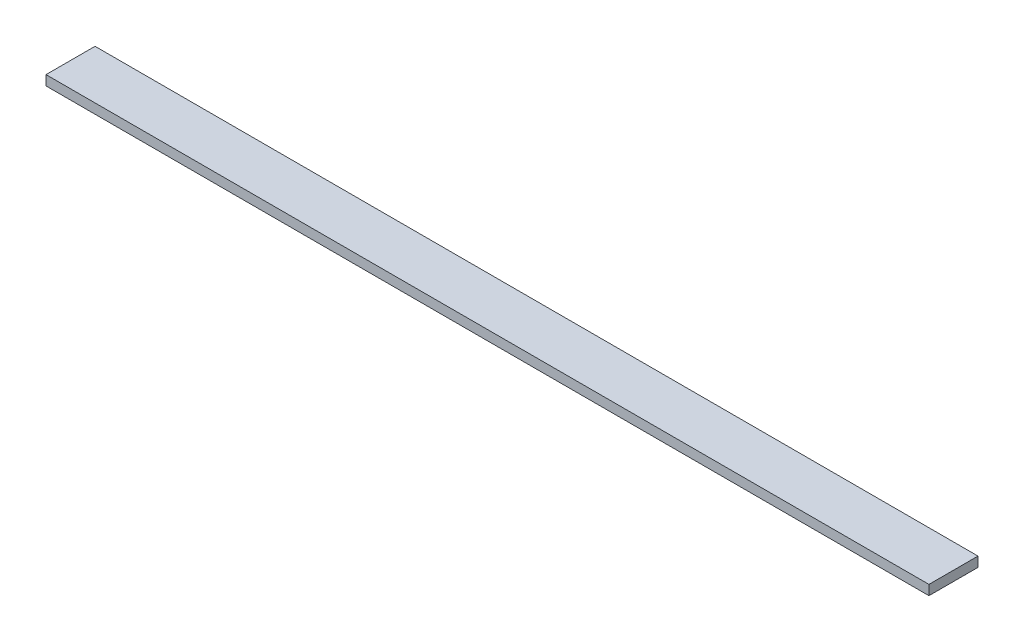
ISO-10303-21;
HEADER;
FILE_DESCRIPTION(('STEP AP214'),'2;1');
FILE_NAME('part.step','',(''),(''),'','','');
FILE_SCHEMA(('AUTOMOTIVE_DESIGN { 1 0 10303 214 1 1 1 1 }'));
ENDSEC;
DATA;
#1=APPLICATION_CONTEXT('core data for automotive mechanical design processes');
#2=APPLICATION_PROTOCOL_DEFINITION('international standard','automotive_design',2000,#1);
#3=PRODUCT_CONTEXT('',#1,'mechanical');
#4=PRODUCT('Part','Part','',(#3));
#5=PRODUCT_RELATED_PRODUCT_CATEGORY('part','',(#4));
#6=PRODUCT_DEFINITION_FORMATION('','',#4);
#7=PRODUCT_DEFINITION_CONTEXT('part definition',#1,'design');
#8=PRODUCT_DEFINITION('design','',#6,#7);
#9=PRODUCT_DEFINITION_SHAPE('','',#8);
#10=(LENGTH_UNIT() NAMED_UNIT(*) SI_UNIT(.MILLI.,.METRE.));
#11=(NAMED_UNIT(*) PLANE_ANGLE_UNIT() SI_UNIT($,.RADIAN.));
#12=(NAMED_UNIT(*) SI_UNIT($,.STERADIAN.) SOLID_ANGLE_UNIT());
#13=UNCERTAINTY_MEASURE_WITH_UNIT(LENGTH_MEASURE(1.E-05),#10,'distance_accuracy_value','');
#14=(GEOMETRIC_REPRESENTATION_CONTEXT(3) GLOBAL_UNCERTAINTY_ASSIGNED_CONTEXT((#13)) GLOBAL_UNIT_ASSIGNED_CONTEXT((#10,
#11,#12)) REPRESENTATION_CONTEXT('',''));
#15=CARTESIAN_POINT('',(0.,0.,0.));
#16=DIRECTION('',(0.,0.,1.));
#17=DIRECTION('',(1.,0.,0.));
#18=AXIS2_PLACEMENT_3D('',#15,#16,#17);
#19=CARTESIAN_POINT('',(180.,1.,-5.));
#20=DIRECTION('',(0.,0.,1.));
#21=DIRECTION('',(1.,0.,0.));
#22=AXIS2_PLACEMENT_3D('',#19,#20,#21);
#23=PLANE('',#22);
#24=DIRECTION('',(0.,1.,0.));
#25=VECTOR('',#24,1.);
#26=CARTESIAN_POINT('',(0.,1.,-5.));
#27=LINE('',#26,#25);
#28=CARTESIAN_POINT('',(0.,-1.,-5.));
#29=VERTEX_POINT('',#28);
#30=CARTESIAN_POINT('',(0.,1.,-5.));
#31=VERTEX_POINT('',#30);
#32=EDGE_CURVE('E96',#29,#31,#27,.T.);
#33=ORIENTED_EDGE('',*,*,#32,.T.);
#34=DIRECTION('',(-1.,0.,0.));
#35=VECTOR('',#34,1.);
#36=CARTESIAN_POINT('',(180.,1.,-5.));
#37=LINE('',#36,#35);
#38=CARTESIAN_POINT('',(180.,1.,-5.));
#39=VERTEX_POINT('',#38);
#40=EDGE_CURVE('E11',#39,#31,#37,.T.);
#41=ORIENTED_EDGE('',*,*,#40,.F.);
#42=DIRECTION('',(0.,1.,0.));
#43=VECTOR('',#42,1.);
#44=CARTESIAN_POINT('',(180.,1.,-5.));
#45=LINE('',#44,#43);
#46=CARTESIAN_POINT('',(180.,-1.,-5.));
#47=VERTEX_POINT('',#46);
#48=EDGE_CURVE('E84',#47,#39,#45,.T.);
#49=ORIENTED_EDGE('',*,*,#48,.F.);
#50=DIRECTION('',(-1.,0.,0.));
#51=VECTOR('',#50,1.);
#52=CARTESIAN_POINT('',(180.,-1.,-5.));
#53=LINE('',#52,#51);
#54=EDGE_CURVE('E92',#47,#29,#53,.T.);
#55=ORIENTED_EDGE('',*,*,#54,.T.);
#56=EDGE_LOOP('',(#33,#41,#49,#55));
#57=FACE_BOUND('',#56,.T.);
#58=ADVANCED_FACE('F33',(#57),#23,.F.);
#59=CARTESIAN_POINT('',(180.,1.,5.));
#60=DIRECTION('',(0.,-1.,0.));
#61=DIRECTION('',(0.,0.,-1.));
#62=AXIS2_PLACEMENT_3D('',#59,#60,#61);
#63=PLANE('',#62);
#64=DIRECTION('',(0.,0.,1.));
#65=VECTOR('',#64,1.);
#66=CARTESIAN_POINT('',(0.,1.,5.));
#67=LINE('',#66,#65);
#68=CARTESIAN_POINT('',(0.,1.,5.));
#69=VERTEX_POINT('',#68);
#70=EDGE_CURVE('E88',#31,#69,#67,.T.);
#71=ORIENTED_EDGE('',*,*,#70,.T.);
#72=DIRECTION('',(-1.,0.,0.));
#73=VECTOR('',#72,1.);
#74=CARTESIAN_POINT('',(180.,1.,5.));
#75=LINE('',#74,#73);
#76=CARTESIAN_POINT('',(180.,1.,5.));
#77=VERTEX_POINT('',#76);
#78=EDGE_CURVE('E41',#77,#69,#75,.T.);
#79=ORIENTED_EDGE('',*,*,#78,.F.);
#80=DIRECTION('',(0.,0.,1.));
#81=VECTOR('',#80,1.);
#82=CARTESIAN_POINT('',(180.,1.,5.));
#83=LINE('',#82,#81);
#84=EDGE_CURVE('E79',#39,#77,#83,.T.);
#85=ORIENTED_EDGE('',*,*,#84,.F.);
#86=ORIENTED_EDGE('',*,*,#40,.T.);
#87=EDGE_LOOP('',(#71,#79,#85,#86));
#88=FACE_BOUND('',#87,.T.);
#89=ADVANCED_FACE('F87',(#88),#63,.F.);
#90=CARTESIAN_POINT('',(180.,1.,5.));
#91=DIRECTION('',(0.,0.,-1.));
#92=DIRECTION('',(-1.,0.,0.));
#93=AXIS2_PLACEMENT_3D('',#90,#91,#92);
#94=PLANE('',#93);
#95=DIRECTION('',(0.,-1.,0.));
#96=VECTOR('',#95,1.);
#97=CARTESIAN_POINT('',(0.,1.,5.));
#98=LINE('',#97,#96);
#99=CARTESIAN_POINT('',(0.,-1.,5.));
#100=VERTEX_POINT('',#99);
#101=EDGE_CURVE('E66',#69,#100,#98,.T.);
#102=ORIENTED_EDGE('',*,*,#101,.T.);
#103=DIRECTION('',(-1.,0.,0.));
#104=VECTOR('',#103,1.);
#105=CARTESIAN_POINT('',(180.,-1.,5.));
#106=LINE('',#105,#104);
#107=CARTESIAN_POINT('',(180.,-1.,5.));
#108=VERTEX_POINT('',#107);
#109=EDGE_CURVE('E89',#108,#100,#106,.T.);
#110=ORIENTED_EDGE('',*,*,#109,.F.);
#111=DIRECTION('',(0.,-1.,0.));
#112=VECTOR('',#111,1.);
#113=CARTESIAN_POINT('',(180.,1.,5.));
#114=LINE('',#113,#112);
#115=EDGE_CURVE('E82',#77,#108,#114,.T.);
#116=ORIENTED_EDGE('',*,*,#115,.F.);
#117=ORIENTED_EDGE('',*,*,#78,.T.);
#118=EDGE_LOOP('',(#102,#110,#116,#117));
#119=FACE_BOUND('',#118,.T.);
#120=ADVANCED_FACE('F90',(#119),#94,.F.);
#121=CARTESIAN_POINT('',(180.,-1.,5.));
#122=DIRECTION('',(0.,1.,0.));
#123=DIRECTION('',(0.,0.,1.));
#124=AXIS2_PLACEMENT_3D('',#121,#122,#123);
#125=PLANE('',#124);
#126=DIRECTION('',(0.,0.,-1.));
#127=VECTOR('',#126,1.);
#128=CARTESIAN_POINT('',(0.,-1.,5.));
#129=LINE('',#128,#127);
#130=EDGE_CURVE('E72',#100,#29,#129,.T.);
#131=ORIENTED_EDGE('',*,*,#130,.T.);
#132=ORIENTED_EDGE('',*,*,#54,.F.);
#133=DIRECTION('',(0.,0.,-1.));
#134=VECTOR('',#133,1.);
#135=CARTESIAN_POINT('',(180.,-1.,5.));
#136=LINE('',#135,#134);
#137=EDGE_CURVE('E49',#108,#47,#136,.T.);
#138=ORIENTED_EDGE('',*,*,#137,.F.);
#139=ORIENTED_EDGE('',*,*,#109,.T.);
#140=EDGE_LOOP('',(#131,#132,#138,#139));
#141=FACE_BOUND('',#140,.T.);
#142=ADVANCED_FACE('F103',(#141),#125,.F.);
#143=CARTESIAN_POINT('',(180.,0.,0.));
#144=DIRECTION('',(1.,0.,0.));
#145=DIRECTION('',(0.,0.,-1.));
#146=AXIS2_PLACEMENT_3D('',#143,#144,#145);
#147=PLANE('',#146);
#148=ORIENTED_EDGE('',*,*,#48,.T.);
#149=ORIENTED_EDGE('',*,*,#84,.T.);
#150=ORIENTED_EDGE('',*,*,#115,.T.);
#151=ORIENTED_EDGE('',*,*,#137,.T.);
#152=EDGE_LOOP('',(#148,#149,#150,#151));
#153=FACE_BOUND('',#152,.T.);
#154=ADVANCED_FACE('F80',(#153),#147,.T.);
#155=CARTESIAN_POINT('',(0.,0.,0.));
#156=DIRECTION('',(1.,0.,0.));
#157=DIRECTION('',(0.,0.,-1.));
#158=AXIS2_PLACEMENT_3D('',#155,#156,#157);
#159=PLANE('',#158);
#160=ORIENTED_EDGE('',*,*,#32,.F.);
#161=ORIENTED_EDGE('',*,*,#130,.F.);
#162=ORIENTED_EDGE('',*,*,#101,.F.);
#163=ORIENTED_EDGE('',*,*,#70,.F.);
#164=EDGE_LOOP('',(#160,#161,#162,#163));
#165=FACE_BOUND('',#164,.T.);
#166=ADVANCED_FACE('F106',(#165),#159,.F.);
#167=CLOSED_SHELL('',(#58,#89,#120,#142,#154,#166));
#168=MANIFOLD_SOLID_BREP('B2',#167);
#169=ADVANCED_BREP_SHAPE_REPRESENTATION('',(#18,#168),#14);
#170=SHAPE_DEFINITION_REPRESENTATION(#9,#169);
ENDSEC;
END-ISO-10303-21;
